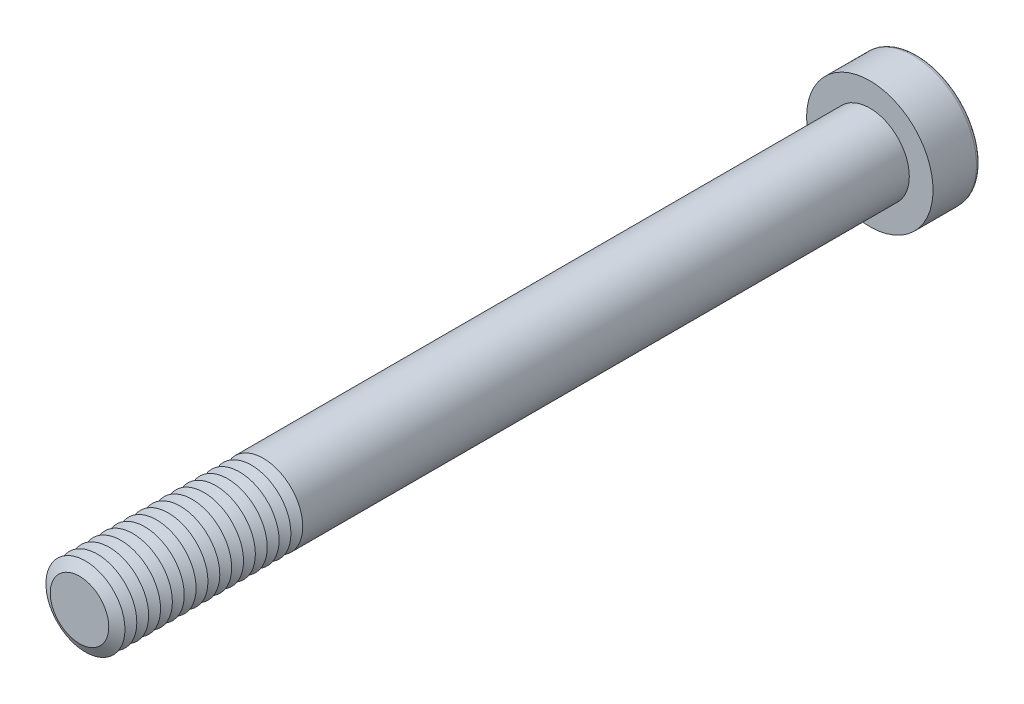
from build123d import *

# Parameters (mm, degrees)
SKETCH1_R           = 5
BOSS_EXTRUDE1_DEPTH = 100
SKETCH2_R           = 8
BOSS_EXTRUDE2_DEPTH = 6
CUT_EXTRUDE1_DEPTH  = 5.25
FILLET1_R           = 0.5
LPATTERN1_COUNT     = 16
LPATTERN1_PITCH     = 1.5


with BuildPart() as part:
    # Sketch1 → Boss-Extrude1 (new body)
    with BuildSketch(Plane.XY):
        Circle(SKETCH1_R)
    extrude(amount=BOSS_EXTRUDE1_DEPTH)

    # Sketch2 → Boss-Extrude2 (add)
    with BuildSketch(Plane(origin=(0, 0, 0), x_dir=(-1, 0, 0), z_dir=(0, 0, -1))):
        Circle(SKETCH2_R)
    extrude(amount=BOSS_EXTRUDE2_DEPTH)

    # Sketch3 → Cut-Extrude1 (cut)
    with BuildSketch(Plane(origin=(0, 0, -6), x_dir=(-1, 0, 0), z_dir=(0, 0, -1))):
        Polygon((-2.020725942, 3.5), (-4.041451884, 0), (-2.020725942, -3.5), (2.020725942, -3.5), (4.041451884, 0), (2.020725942, 3.5), align=None)
    extrude(amount=-CUT_EXTRUDE1_DEPTH, mode=Mode.SUBTRACT)

    # Fillet1
    fillet1_edges = [part.edges().sort_by_distance(p)[0] for p in [
        (8, 0, -6),
    ]]
    fillet(fillet1_edges, radius=FILLET1_R)

    # Cut-Extrude2 cone 1 section (on through the dimple's axis) → Cut-Extrude2 (revolve, cut)
    with BuildSketch(Plane(origin=(0, 0, -0.75), x_dir=(0, 1, 0), z_dir=(1, 0, 0))):
        Polygon((0, 0), (3.5, 0), (0, 2.020725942), align=None)
    revolve(axis=Axis((0, 0, -0.75), (0, 0, 1)), mode=Mode.SUBTRACT)

    # Cut-Extrude3 cone 1 section (on through the dimple's axis) → Cut-Extrude3 (revolve, cut)
    with BuildSketch(Plane(origin=(0, 0, -6), x_dir=(0, 1, 0), z_dir=(1, 0, 0))):
        Polygon((0, 0), (4.041451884, 0), (0, 1.082903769), align=None)
    revolve(axis=Axis((0, 0, -6), (0, 0, 1)), mode=Mode.SUBTRACT)

    # Sketch7 → Cut-Revolve1 (revolve, cut)
    with BuildSketch(Plane(origin=(0, 0, 0), x_dir=(0, 0, -1), z_dir=(1, 0, 0)), mode=Mode.PRIVATE) as cut_revolve1_sk:
        Polygon((-100, 3.700961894), (-99.25, 5), (-100.75, 5), align=None)
    cut_revolve1 = revolve(cut_revolve1_sk.sketch.rotate(Axis((0, 0, 100), (0, 0, -1)), 90), axis=Axis((0, 0, 100), (0, 0, -1)), mode=Mode.SUBTRACT)

    # LPattern1: Cut-Revolve1 ×16
    with Locations(*[(0, 0, -i * LPATTERN1_PITCH) for i in range(1, LPATTERN1_COUNT)]):
        add(cut_revolve1, mode=Mode.SUBTRACT)


solid = part.part
